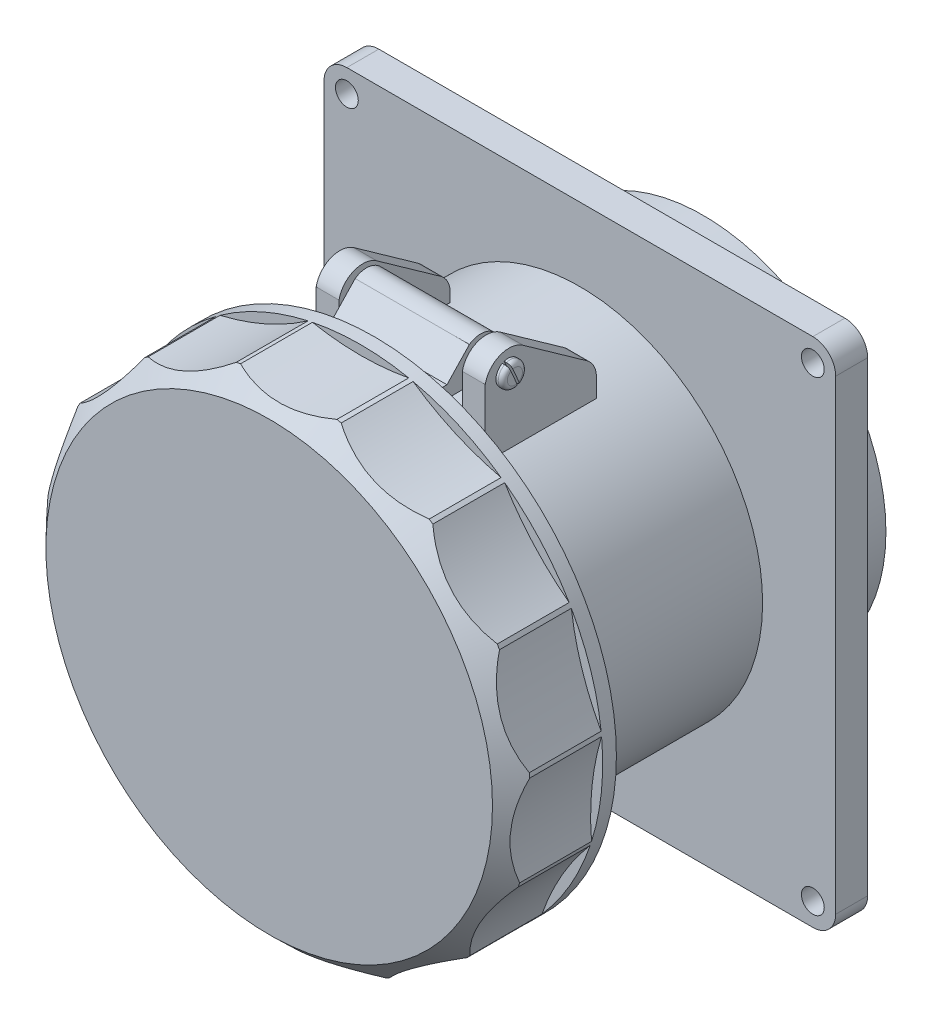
from build123d import *

# Parameters (mm, degrees)
ESBO_O1_R              = 2.5
EXTRUS_O1_DEPTH        = 7
EXTRUS_O2_DEPTH        = 45
ESBO_O3_R              = 53
EXTRUS_O3_DEPTH        = 23
CORTE_EXTRUS_O1_DEPTH  = 20
CIRPATTERN1_COUNT      = 15
EXTRUS_O4_START        = -43.5
ESBO_O5_R              = 2
EXTRUS_O4_DEPTH        = 25
EXTRUS_O5_START        = 1
EXTRUS_O5_DEPTH        = 5
EXTRUS_O6_DEPTH        = 1.5
FILETE1_R              = 1
FILETE1_OF_ESPELHAR2_R = 1
EXTRUS_O7_START        = 20
ESBO_O8_R              = 40
EXTRUS_O7_DEPTH        = 20
ESBO_O9_OUTSIDE_W      = 170.254
ESBO_O9_OUTSIDE_H      = 170.254
ESBO_O9_OUTSIDE_R      = 48.876829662
CORTE_EXTRUS_O2_DEPTH  = 10
CORTE_EXTRUS_O2_DRAFT  = -44


with BuildPart() as part:
    # Esbo_o1 → Extrus_o1 (new body)
    with BuildSketch(Plane.XY):
        with BuildLine():
            Line((-51, 56), (51, 56))
            ThreePointArc((51, 56), (54.535533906, 54.535533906), (56, 51))
            Line((56, 51), (56, -51))
            ThreePointArc((56, -51), (54.535533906, -54.535533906), (51, -56))
            Line((51, -56), (-51, -56))
            ThreePointArc((-51, -56), (-54.535533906, -54.535533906), (-56, -51))
            Line((-56, -51), (-56, 51))
            ThreePointArc((-56, 51), (-54.535533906, 54.535533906), (-51, 56))
        make_face()
        with Locations((-51, 51)):
            Circle(ESBO_O1_R, mode=Mode.SUBTRACT)
        with Locations(Location((51, 51, 0), (0, 0, 180))):
            Circle(ESBO_O1_R, mode=Mode.SUBTRACT)
        with Locations((51, -51)):
            Circle(ESBO_O1_R, mode=Mode.SUBTRACT)
        with Locations(Location((-51, -51, 0), (0, 0, 180))):
            Circle(ESBO_O1_R, mode=Mode.SUBTRACT)
    extrude(amount=EXTRUS_O1_DEPTH)

    # Esbo_o2 → Extrus_o2 (add)
    with BuildSketch(Plane.XY.offset(7)):
        with BuildLine():
            ThreePointArc((7.466968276, -39.296875), (0, 40), (-7.466968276, -39.296875))
            ThreePointArc((-7.466968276, -39.296875), (0, -47.5), (7.466968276, -39.296875))
        make_face()
    extrude(amount=EXTRUS_O2_DEPTH)

    # Esbo_o3 → Extrus_o3 (add)
    with BuildSketch(Plane.XY.offset(52)):
        Circle(ESBO_O3_R)
    extrude(amount=EXTRUS_O3_DEPTH)

    # Esbo_o4 → Corte-extrus_o1 (cut)
    with BuildSketch(Plane.XY.offset(75)):
        with BuildLine():
            Line((-10.54225132, 51.940937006), (-10.54225132, 54.205628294))
            Line((-10.54225132, 54.205628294), (10.54225132, 54.205628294))
            Line((10.54225132, 54.205628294), (10.54225132, 51.940937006))
            ThreePointArc((10.54225132, 51.940937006), (0, 50.942275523), (-10.54225132, 51.940937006))
        make_face()
    corte_extrus_o1 = extrude(amount=-CORTE_EXTRUS_O1_DEPTH, mode=Mode.SUBTRACT)

    # CirPattern1: Corte-extrus_o1 ×15 about axis
    cirpattern1_axis = Axis((0, 0, 0), (0, 0, 1))
    for i in range(1, CIRPATTERN1_COUNT):
        add(corte_extrus_o1.rotate(cirpattern1_axis, i * 360 / CIRPATTERN1_COUNT), mode=Mode.SUBTRACT)

    # Esbo_o5 → Extrus_o4 (add)
    with BuildSketch(Plane(origin=(56, 0, 0), x_dir=(0, 0, -1), z_dir=(1, 0, 0)).offset(EXTRUS_O4_START)):
        with BuildLine():
            Line((-52, 48.425161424), (-48.590061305, 48.425161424))
            Line((-48.590061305, 48.425161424), (-43.681255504, 53.601126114))
            ThreePointArc((-43.681255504, 53.601126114), (-37.105802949, 51.376736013), (-41.208427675, 45.7773648))
            Line((-41.208427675, 45.7773648), (-52, 45.7773648))
            Line((-52, 45.7773648), (-53.584045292, 45.7773648))
            Line((-53.584045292, 45.7773648), (-53.584045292, 48.425161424))
            Line((-53.584045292, 48.425161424), (-52, 48.425161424))
        make_face()
        with Locations(Location((-41.208427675, 50.080034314, 0), (0, 0, 90))):
            Circle(ESBO_O5_R, mode=Mode.SUBTRACT)
    extrude(amount=-EXTRUS_O4_DEPTH)

    # Esbo_o6 → Extrus_o5 (add)
    with BuildSketch(Plane(origin=(12.5, 0, 0), x_dir=(0, 0, -1), z_dir=(1, 0, 0)).offset(EXTRUS_O5_START)):
        with BuildLine():
            Line((-46.209714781, 50.276534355), (-46.209714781, 26.165155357))
            Line((-46.209714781, 26.165155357), (-21.876287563, 26.165155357))
            Line((-21.876287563, 26.165155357), (-21.876287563, 39.594135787))
            ThreePointArc((-21.876287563, 39.594135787), (-22.43356005, 41.888078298), (-23.981156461, 43.67068039))
            Line((-23.981156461, 43.67068039), (-37.956764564, 53.596051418))
            ThreePointArc((-37.956764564, 53.596051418), (-42.989920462, 54.190473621), (-46.209714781, 50.276534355))
        make_face()
    extrus_o5 = extrude(amount=EXTRUS_O5_DEPTH)

    # Espelhar1: Extrus_o5 across plane
    add(extrus_o5.mirror(Plane(origin=(0, 0, 0), x_dir=(0, 0, 1), z_dir=(1, 0, 0))))

    # Esbo_o7 → Extrus_o6 (add)
    with BuildSketch(Plane(origin=(18.5, 0, 0), x_dir=(0, 0, -1), z_dir=(1, 0, 0))):
        with BuildLine():
            Line((-42.48547616, 52.414398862), (-40.3906817, 47.547959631))
            ThreePointArc((-40.3906817, 47.547959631), (-43.652460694, 49.027982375), (-42.48547616, 52.414398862))
        make_face()
        with BuildLine():
            Line((-39.962056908, 47.729147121), (-42.059260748, 52.601183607))
            ThreePointArc((-42.059260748, 52.601183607), (-38.764394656, 51.132086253), (-39.962056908, 47.729147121))
        make_face()
    extrus_o6 = extrude(amount=EXTRUS_O6_DEPTH)

    # Filete1
    filete1_edges = [part.edges().sort_by_distance(p)[0] for p in [
        (20, 49.027982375, 43.652460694),
        (20, 51.132086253, 38.764394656),
    ]]
    fillet(filete1_edges, radius=FILETE1_R)

    # Espelhar2: Extrus_o6 across plane
    add(extrus_o6.mirror(Plane(origin=(0, 0, 0), x_dir=(0, 0, 1), z_dir=(1, 0, 0))))

    # Filete1 of Espelhar2
    filete1_of_espelhar2_edges = [part.edges().sort_by_distance(p)[0] for p in [
        (-20, 49.027982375, 43.652460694),
        (-20, 51.132086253, 38.764394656),
    ]]
    fillet(filete1_of_espelhar2_edges, radius=FILETE1_OF_ESPELHAR2_R)

    # Esbo_o8 → Extrus_o7 (add)
    with BuildSketch(Plane(origin=(0, 0, 0), x_dir=(-1, 0, 0), z_dir=(0, 0, -1)).offset(EXTRUS_O7_START)):
        with Locations(Location((0, 0, 0), (0, 0, 180))):
            Circle(ESBO_O8_R)
    extrude(amount=-EXTRUS_O7_DEPTH)


with BuildPart() as corte_extrus_o2_tool:
    # Esbo_o9 outside → Corte-extrus_o2 (with draft: the straight prism first)
    with BuildSketch(Plane.XY.offset(75)):
        Rectangle(ESBO_O9_OUTSIDE_W, ESBO_O9_OUTSIDE_H)
        Circle(ESBO_O9_OUTSIDE_R, mode=Mode.SUBTRACT)
    extrude(amount=-CORTE_EXTRUS_O2_DEPTH)
    # Corte-extrus_o2: the draft: its side faces are tilted about the plane it starts from
    corte_extrus_o2_sides = [corte_extrus_o2_tool.faces().sort_by_distance(p)[0] for p in [
        (0, -85.127, 70),
        (85.127, 0, 70),
        (0, 85.127, 70),
        (-85.127, 0, 70),
        (-48.876829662, 0, 70),
    ]]
    draft(corte_extrus_o2_sides, Plane.XY.offset(75), CORTE_EXTRUS_O2_DRAFT)


with BuildPart() as part_1:
    add(part.part)

    # Corte-extrus_o2: cut by corte_extrus_o2_tool
    add(corte_extrus_o2_tool.part, mode=Mode.SUBTRACT)


solid = part_1.part
